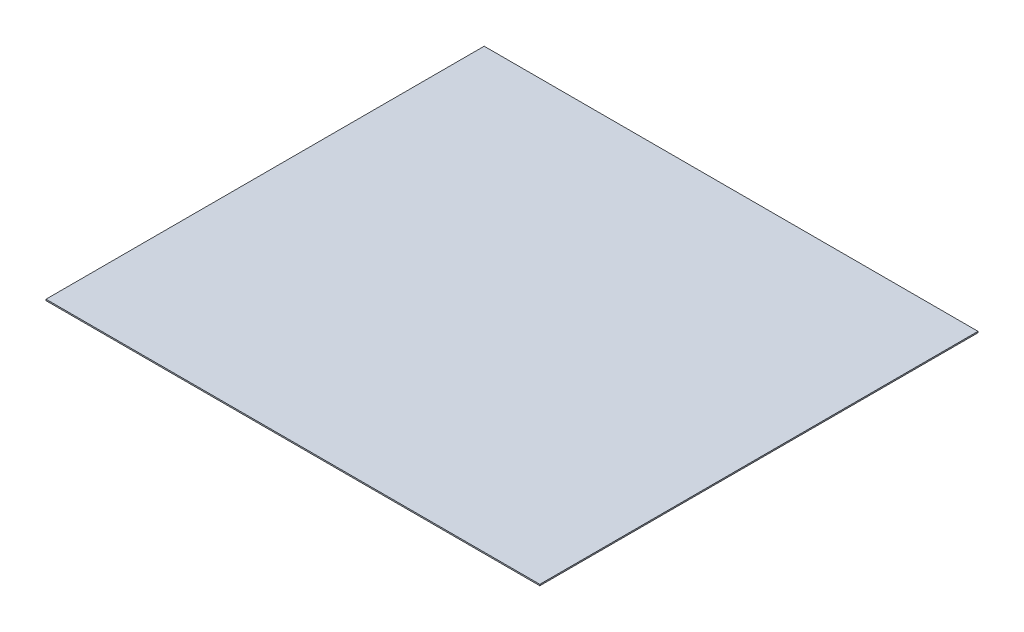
ISO-10303-21;
HEADER;
FILE_DESCRIPTION(('STEP AP214'),'2;1');
FILE_NAME('part.step','',(''),(''),'','','');
FILE_SCHEMA(('AUTOMOTIVE_DESIGN { 1 0 10303 214 1 1 1 1 }'));
ENDSEC;
DATA;
#1=APPLICATION_CONTEXT('core data for automotive mechanical design processes');
#2=APPLICATION_PROTOCOL_DEFINITION('international standard','automotive_design',2000,#1);
#3=PRODUCT_CONTEXT('',#1,'mechanical');
#4=PRODUCT('Part','Part','',(#3));
#5=PRODUCT_RELATED_PRODUCT_CATEGORY('part','',(#4));
#6=PRODUCT_DEFINITION_FORMATION('','',#4);
#7=PRODUCT_DEFINITION_CONTEXT('part definition',#1,'design');
#8=PRODUCT_DEFINITION('design','',#6,#7);
#9=PRODUCT_DEFINITION_SHAPE('','',#8);
#10=(LENGTH_UNIT() NAMED_UNIT(*) SI_UNIT(.MILLI.,.METRE.));
#11=(NAMED_UNIT(*) PLANE_ANGLE_UNIT() SI_UNIT($,.RADIAN.));
#12=(NAMED_UNIT(*) SI_UNIT($,.STERADIAN.) SOLID_ANGLE_UNIT());
#13=UNCERTAINTY_MEASURE_WITH_UNIT(LENGTH_MEASURE(1.E-05),#10,'distance_accuracy_value','');
#14=(GEOMETRIC_REPRESENTATION_CONTEXT(3) GLOBAL_UNCERTAINTY_ASSIGNED_CONTEXT((#13)) GLOBAL_UNIT_ASSIGNED_CONTEXT((#10,
#11,#12)) REPRESENTATION_CONTEXT('',''));
#15=CARTESIAN_POINT('',(0.,0.,0.));
#16=DIRECTION('',(0.,0.,1.));
#17=DIRECTION('',(1.,0.,0.));
#18=AXIS2_PLACEMENT_3D('',#15,#16,#17);
#19=CARTESIAN_POINT('',(901.7,4.7625,-800.1));
#20=DIRECTION('',(-1.,0.,0.));
#21=DIRECTION('',(0.,0.,1.));
#22=AXIS2_PLACEMENT_3D('',#19,#20,#21);
#23=PLANE('',#22);
#24=DIRECTION('',(0.,0.,-1.));
#25=VECTOR('',#24,1.);
#26=CARTESIAN_POINT('',(901.7,0.,-800.1));
#27=LINE('',#26,#25);
#28=CARTESIAN_POINT('',(901.7,0.,800.1));
#29=VERTEX_POINT('',#28);
#30=CARTESIAN_POINT('',(901.7,0.,-800.1));
#31=VERTEX_POINT('',#30);
#32=EDGE_CURVE('E98',#29,#31,#27,.T.);
#33=ORIENTED_EDGE('',*,*,#32,.T.);
#34=DIRECTION('',(0.,-1.,0.));
#35=VECTOR('',#34,1.);
#36=CARTESIAN_POINT('',(901.7,4.7625,-800.1));
#37=LINE('',#36,#35);
#38=CARTESIAN_POINT('',(901.7,4.7625,-800.1));
#39=VERTEX_POINT('',#38);
#40=EDGE_CURVE('E11',#39,#31,#37,.T.);
#41=ORIENTED_EDGE('',*,*,#40,.F.);
#42=DIRECTION('',(0.,0.,-1.));
#43=VECTOR('',#42,1.);
#44=CARTESIAN_POINT('',(901.7,4.7625,-800.1));
#45=LINE('',#44,#43);
#46=CARTESIAN_POINT('',(901.7,4.7625,800.1));
#47=VERTEX_POINT('',#46);
#48=EDGE_CURVE('E86',#47,#39,#45,.T.);
#49=ORIENTED_EDGE('',*,*,#48,.F.);
#50=DIRECTION('',(0.,-1.,0.));
#51=VECTOR('',#50,1.);
#52=CARTESIAN_POINT('',(901.7,4.7625,800.1));
#53=LINE('',#52,#51);
#54=EDGE_CURVE('E94',#47,#29,#53,.T.);
#55=ORIENTED_EDGE('',*,*,#54,.T.);
#56=EDGE_LOOP('',(#33,#41,#49,#55));
#57=FACE_BOUND('',#56,.T.);
#58=ADVANCED_FACE('F35',(#57),#23,.F.);
#59=CARTESIAN_POINT('',(-901.7,4.7625,-800.1));
#60=DIRECTION('',(0.,0.,1.));
#61=DIRECTION('',(1.,0.,0.));
#62=AXIS2_PLACEMENT_3D('',#59,#60,#61);
#63=PLANE('',#62);
#64=DIRECTION('',(-1.,0.,0.));
#65=VECTOR('',#64,1.);
#66=CARTESIAN_POINT('',(-901.7,0.,-800.1));
#67=LINE('',#66,#65);
#68=CARTESIAN_POINT('',(-901.7,0.,-800.1));
#69=VERTEX_POINT('',#68);
#70=EDGE_CURVE('E90',#31,#69,#67,.T.);
#71=ORIENTED_EDGE('',*,*,#70,.T.);
#72=DIRECTION('',(0.,-1.,0.));
#73=VECTOR('',#72,1.);
#74=CARTESIAN_POINT('',(-901.7,4.7625,-800.1));
#75=LINE('',#74,#73);
#76=CARTESIAN_POINT('',(-901.7,4.7625,-800.1));
#77=VERTEX_POINT('',#76);
#78=EDGE_CURVE('E43',#77,#69,#75,.T.);
#79=ORIENTED_EDGE('',*,*,#78,.F.);
#80=DIRECTION('',(-1.,0.,0.));
#81=VECTOR('',#80,1.);
#82=CARTESIAN_POINT('',(-901.7,4.7625,-800.1));
#83=LINE('',#82,#81);
#84=EDGE_CURVE('E81',#39,#77,#83,.T.);
#85=ORIENTED_EDGE('',*,*,#84,.F.);
#86=ORIENTED_EDGE('',*,*,#40,.T.);
#87=EDGE_LOOP('',(#71,#79,#85,#86));
#88=FACE_BOUND('',#87,.T.);
#89=ADVANCED_FACE('F89',(#88),#63,.F.);
#90=CARTESIAN_POINT('',(-901.7,4.7625,-800.1));
#91=DIRECTION('',(1.,0.,0.));
#92=DIRECTION('',(0.,0.,-1.));
#93=AXIS2_PLACEMENT_3D('',#90,#91,#92);
#94=PLANE('',#93);
#95=DIRECTION('',(0.,0.,1.));
#96=VECTOR('',#95,1.);
#97=CARTESIAN_POINT('',(-901.7,0.,-800.1));
#98=LINE('',#97,#96);
#99=CARTESIAN_POINT('',(-901.7,0.,800.1));
#100=VERTEX_POINT('',#99);
#101=EDGE_CURVE('E68',#69,#100,#98,.T.);
#102=ORIENTED_EDGE('',*,*,#101,.T.);
#103=DIRECTION('',(0.,-1.,0.));
#104=VECTOR('',#103,1.);
#105=CARTESIAN_POINT('',(-901.7,4.7625,800.1));
#106=LINE('',#105,#104);
#107=CARTESIAN_POINT('',(-901.7,4.7625,800.1));
#108=VERTEX_POINT('',#107);
#109=EDGE_CURVE('E91',#108,#100,#106,.T.);
#110=ORIENTED_EDGE('',*,*,#109,.F.);
#111=DIRECTION('',(0.,0.,1.));
#112=VECTOR('',#111,1.);
#113=CARTESIAN_POINT('',(-901.7,4.7625,-800.1));
#114=LINE('',#113,#112);
#115=EDGE_CURVE('E84',#77,#108,#114,.T.);
#116=ORIENTED_EDGE('',*,*,#115,.F.);
#117=ORIENTED_EDGE('',*,*,#78,.T.);
#118=EDGE_LOOP('',(#102,#110,#116,#117));
#119=FACE_BOUND('',#118,.T.);
#120=ADVANCED_FACE('F92',(#119),#94,.F.);
#121=CARTESIAN_POINT('',(-901.7,4.7625,800.1));
#122=DIRECTION('',(0.,0.,-1.));
#123=DIRECTION('',(-1.,0.,0.));
#124=AXIS2_PLACEMENT_3D('',#121,#122,#123);
#125=PLANE('',#124);
#126=DIRECTION('',(1.,0.,0.));
#127=VECTOR('',#126,1.);
#128=CARTESIAN_POINT('',(-901.7,0.,800.1));
#129=LINE('',#128,#127);
#130=EDGE_CURVE('E74',#100,#29,#129,.T.);
#131=ORIENTED_EDGE('',*,*,#130,.T.);
#132=ORIENTED_EDGE('',*,*,#54,.F.);
#133=DIRECTION('',(1.,0.,0.));
#134=VECTOR('',#133,1.);
#135=CARTESIAN_POINT('',(-901.7,4.7625,800.1));
#136=LINE('',#135,#134);
#137=EDGE_CURVE('E51',#108,#47,#136,.T.);
#138=ORIENTED_EDGE('',*,*,#137,.F.);
#139=ORIENTED_EDGE('',*,*,#109,.T.);
#140=EDGE_LOOP('',(#131,#132,#138,#139));
#141=FACE_BOUND('',#140,.T.);
#142=ADVANCED_FACE('F105',(#141),#125,.F.);
#143=CARTESIAN_POINT('',(901.699999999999,4.7625,800.1));
#144=DIRECTION('',(0.,1.,0.));
#145=DIRECTION('',(0.,0.,1.));
#146=AXIS2_PLACEMENT_3D('',#143,#144,#145);
#147=PLANE('',#146);
#148=ORIENTED_EDGE('',*,*,#48,.T.);
#149=ORIENTED_EDGE('',*,*,#84,.T.);
#150=ORIENTED_EDGE('',*,*,#115,.T.);
#151=ORIENTED_EDGE('',*,*,#137,.T.);
#152=EDGE_LOOP('',(#148,#149,#150,#151));
#153=FACE_BOUND('',#152,.T.);
#154=ADVANCED_FACE('F82',(#153),#147,.T.);
#155=CARTESIAN_POINT('',(901.699999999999,0.,800.1));
#156=DIRECTION('',(0.,1.,0.));
#157=DIRECTION('',(0.,0.,1.));
#158=AXIS2_PLACEMENT_3D('',#155,#156,#157);
#159=PLANE('',#158);
#160=ORIENTED_EDGE('',*,*,#32,.F.);
#161=ORIENTED_EDGE('',*,*,#130,.F.);
#162=ORIENTED_EDGE('',*,*,#101,.F.);
#163=ORIENTED_EDGE('',*,*,#70,.F.);
#164=EDGE_LOOP('',(#160,#161,#162,#163));
#165=FACE_BOUND('',#164,.T.);
#166=ADVANCED_FACE('F108',(#165),#159,.F.);
#167=CLOSED_SHELL('',(#58,#89,#120,#142,#154,#166));
#168=MANIFOLD_SOLID_BREP('B2',#167);
#169=ADVANCED_BREP_SHAPE_REPRESENTATION('',(#18,#168),#14);
#170=SHAPE_DEFINITION_REPRESENTATION(#9,#169);
ENDSEC;
END-ISO-10303-21;
